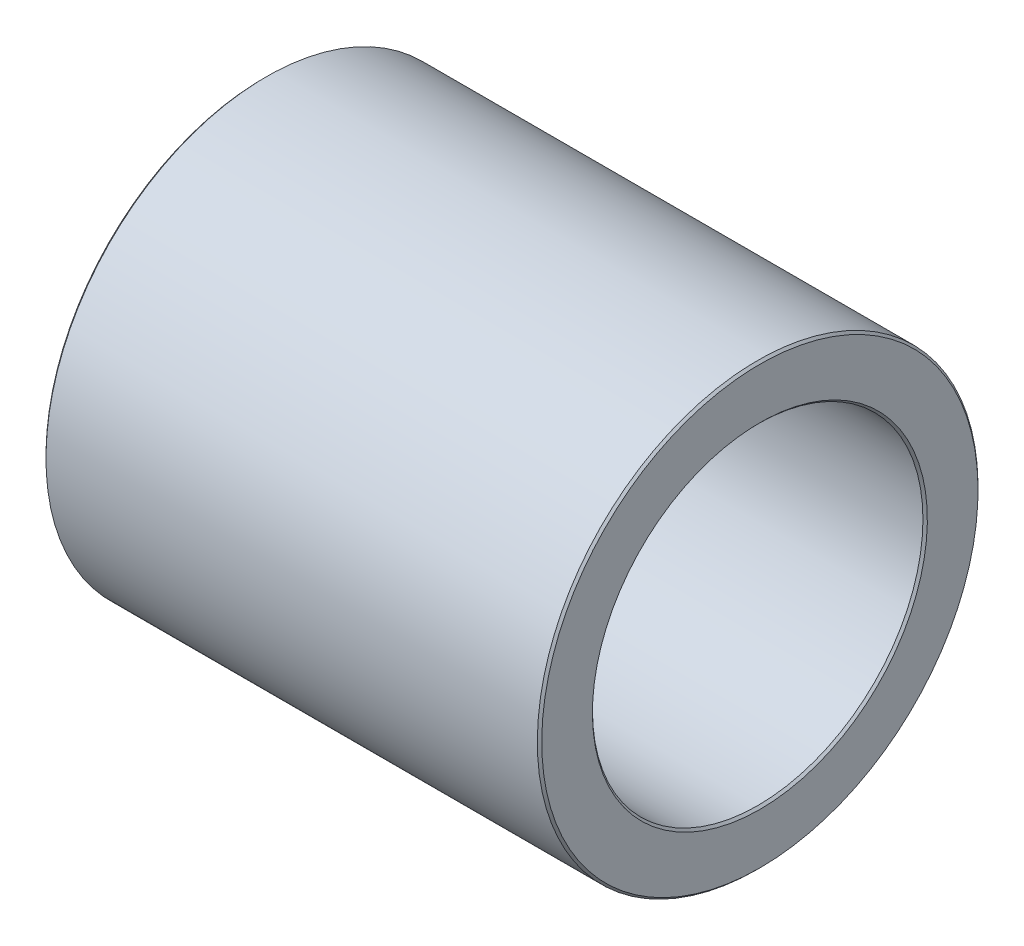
ISO-10303-21;
HEADER;
FILE_DESCRIPTION(('STEP AP214'),'2;1');
FILE_NAME('part.step','',(''),(''),'','','');
FILE_SCHEMA(('AUTOMOTIVE_DESIGN { 1 0 10303 214 1 1 1 1 }'));
ENDSEC;
DATA;
#1=APPLICATION_CONTEXT('core data for automotive mechanical design processes');
#2=APPLICATION_PROTOCOL_DEFINITION('international standard','automotive_design',2000,#1);
#3=PRODUCT_CONTEXT('',#1,'mechanical');
#4=PRODUCT('Part','Part','',(#3));
#5=PRODUCT_RELATED_PRODUCT_CATEGORY('part','',(#4));
#6=PRODUCT_DEFINITION_FORMATION('','',#4);
#7=PRODUCT_DEFINITION_CONTEXT('part definition',#1,'design');
#8=PRODUCT_DEFINITION('design','',#6,#7);
#9=PRODUCT_DEFINITION_SHAPE('','',#8);
#10=(LENGTH_UNIT() NAMED_UNIT(*) SI_UNIT(.MILLI.,.METRE.));
#11=(NAMED_UNIT(*) PLANE_ANGLE_UNIT() SI_UNIT($,.RADIAN.));
#12=(NAMED_UNIT(*) SI_UNIT($,.STERADIAN.) SOLID_ANGLE_UNIT());
#13=UNCERTAINTY_MEASURE_WITH_UNIT(LENGTH_MEASURE(1.E-05),#10,'distance_accuracy_value','');
#14=(GEOMETRIC_REPRESENTATION_CONTEXT(3) GLOBAL_UNCERTAINTY_ASSIGNED_CONTEXT((#13)) GLOBAL_UNIT_ASSIGNED_CONTEXT((#10,
#11,#12)) REPRESENTATION_CONTEXT('',''));
#15=CARTESIAN_POINT('',(0.,0.,0.));
#16=DIRECTION('',(0.,0.,1.));
#17=DIRECTION('',(1.,0.,0.));
#18=AXIS2_PLACEMENT_3D('',#15,#16,#17);
#19=CARTESIAN_POINT('',(0.,-35.,0.));
#20=DIRECTION('',(-1.,0.,0.));
#21=DIRECTION('',(0.,1.,0.));
#22=AXIS2_PLACEMENT_3D('',#19,#20,#21);
#23=PLANE('',#22);
#24=CARTESIAN_POINT('',(0.,0.,0.));
#25=DIRECTION('',(1.,0.,0.));
#26=DIRECTION('',(0.,-1.,0.));
#27=AXIS2_PLACEMENT_3D('',#24,#25,#26);
#28=CIRCLE('',#27,30.4);
#29=CARTESIAN_POINT('',(0.,-30.4,0.));
#30=VERTEX_POINT('',#29);
#31=EDGE_CURVE('E9',#30,#30,#28,.T.);
#32=ORIENTED_EDGE('',*,*,#31,.T.);
#33=EDGE_LOOP('',(#32));
#34=FACE_BOUND('',#33,.T.);
#35=CARTESIAN_POINT('',(0.,0.,0.));
#36=DIRECTION('',(1.,0.,0.));
#37=DIRECTION('',(0.,-1.,0.));
#38=AXIS2_PLACEMENT_3D('',#35,#36,#37);
#39=CIRCLE('',#38,39.6);
#40=CARTESIAN_POINT('',(0.,-39.6,0.));
#41=VERTEX_POINT('',#40);
#42=EDGE_CURVE('E53',#41,#41,#39,.T.);
#43=ORIENTED_EDGE('',*,*,#42,.F.);
#44=EDGE_LOOP('',(#43));
#45=FACE_BOUND('',#44,.T.);
#46=ADVANCED_FACE('F15',(#34,#45),#23,.T.);
#47=CARTESIAN_POINT('',(0.199999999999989,0.,0.));
#48=DIRECTION('',(-1.,0.,0.));
#49=DIRECTION('',(0.,-1.,0.));
#50=AXIS2_PLACEMENT_3D('',#47,#48,#49);
#51=CONICAL_SURFACE('',#50,30.2,0.785398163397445);
#52=CARTESIAN_POINT('',(0.4,0.,0.));
#53=DIRECTION('',(1.,0.,0.));
#54=DIRECTION('',(0.,-1.,0.));
#55=AXIS2_PLACEMENT_3D('',#52,#53,#54);
#56=CIRCLE('',#55,30.);
#57=CARTESIAN_POINT('',(0.4,-30.,0.));
#58=VERTEX_POINT('',#57);
#59=EDGE_CURVE('E22',#58,#58,#56,.T.);
#60=ORIENTED_EDGE('',*,*,#59,.T.);
#61=EDGE_LOOP('',(#60));
#62=FACE_BOUND('',#61,.T.);
#63=ORIENTED_EDGE('',*,*,#31,.F.);
#64=EDGE_LOOP('',(#63));
#65=FACE_BOUND('',#64,.T.);
#66=ADVANCED_FACE('F82',(#62,#65),#51,.F.);
#67=CARTESIAN_POINT('',(45.,0.,0.));
#68=DIRECTION('',(-1.,0.,0.));
#69=DIRECTION('',(0.,-1.,0.));
#70=AXIS2_PLACEMENT_3D('',#67,#68,#69);
#71=CYLINDRICAL_SURFACE('',#70,30.);
#72=CARTESIAN_POINT('',(89.6,0.,0.));
#73=DIRECTION('',(1.,0.,0.));
#74=DIRECTION('',(0.,-1.,0.));
#75=AXIS2_PLACEMENT_3D('',#72,#73,#74);
#76=CIRCLE('',#75,30.);
#77=CARTESIAN_POINT('',(89.6,-30.,0.));
#78=VERTEX_POINT('',#77);
#79=EDGE_CURVE('E58',#78,#78,#76,.T.);
#80=ORIENTED_EDGE('',*,*,#79,.T.);
#81=EDGE_LOOP('',(#80));
#82=FACE_BOUND('',#81,.T.);
#83=ORIENTED_EDGE('',*,*,#59,.F.);
#84=EDGE_LOOP('',(#83));
#85=FACE_BOUND('',#84,.T.);
#86=ADVANCED_FACE('F66',(#82,#85),#71,.F.);
#87=CARTESIAN_POINT('',(89.8,0.,0.));
#88=DIRECTION('',(1.,0.,0.));
#89=DIRECTION('',(0.,-1.,0.));
#90=AXIS2_PLACEMENT_3D('',#87,#88,#89);
#91=CONICAL_SURFACE('',#90,30.2,0.785398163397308);
#92=CARTESIAN_POINT('',(90.,0.,0.));
#93=DIRECTION('',(1.,0.,0.));
#94=DIRECTION('',(0.,-1.,0.));
#95=AXIS2_PLACEMENT_3D('',#92,#93,#94);
#96=CIRCLE('',#95,30.4);
#97=CARTESIAN_POINT('',(90.,-30.4,0.));
#98=VERTEX_POINT('',#97);
#99=EDGE_CURVE('E63',#98,#98,#96,.T.);
#100=ORIENTED_EDGE('',*,*,#99,.T.);
#101=EDGE_LOOP('',(#100));
#102=FACE_BOUND('',#101,.T.);
#103=ORIENTED_EDGE('',*,*,#79,.F.);
#104=EDGE_LOOP('',(#103));
#105=FACE_BOUND('',#104,.T.);
#106=ADVANCED_FACE('F69',(#102,#105),#91,.F.);
#107=CARTESIAN_POINT('',(90.,-35.,0.));
#108=DIRECTION('',(1.,0.,0.));
#109=DIRECTION('',(0.,-1.,0.));
#110=AXIS2_PLACEMENT_3D('',#107,#108,#109);
#111=PLANE('',#110);
#112=CARTESIAN_POINT('',(90.,0.,0.));
#113=DIRECTION('',(1.,0.,0.));
#114=DIRECTION('',(0.,-1.,0.));
#115=AXIS2_PLACEMENT_3D('',#112,#113,#114);
#116=CIRCLE('',#115,39.6);
#117=CARTESIAN_POINT('',(90.,-39.6,0.));
#118=VERTEX_POINT('',#117);
#119=EDGE_CURVE('E61',#118,#118,#116,.T.);
#120=ORIENTED_EDGE('',*,*,#119,.T.);
#121=EDGE_LOOP('',(#120));
#122=FACE_BOUND('',#121,.T.);
#123=ORIENTED_EDGE('',*,*,#99,.F.);
#124=EDGE_LOOP('',(#123));
#125=FACE_BOUND('',#124,.T.);
#126=ADVANCED_FACE('F71',(#122,#125),#111,.T.);
#127=CARTESIAN_POINT('',(89.8,0.,0.));
#128=DIRECTION('',(-1.,0.,0.));
#129=DIRECTION('',(0.,-1.,0.));
#130=AXIS2_PLACEMENT_3D('',#127,#128,#129);
#131=CONICAL_SURFACE('',#130,39.8,0.785398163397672);
#132=CARTESIAN_POINT('',(89.6,0.,0.));
#133=DIRECTION('',(1.,0.,0.));
#134=DIRECTION('',(0.,-1.,0.));
#135=AXIS2_PLACEMENT_3D('',#132,#133,#134);
#136=CIRCLE('',#135,40.);
#137=CARTESIAN_POINT('',(89.6,-40.,0.));
#138=VERTEX_POINT('',#137);
#139=EDGE_CURVE('E55',#138,#138,#136,.T.);
#140=ORIENTED_EDGE('',*,*,#139,.T.);
#141=EDGE_LOOP('',(#140));
#142=FACE_BOUND('',#141,.T.);
#143=ORIENTED_EDGE('',*,*,#119,.F.);
#144=EDGE_LOOP('',(#143));
#145=FACE_BOUND('',#144,.T.);
#146=ADVANCED_FACE('F79',(#142,#145),#131,.T.);
#147=CARTESIAN_POINT('',(45.,0.,0.));
#148=DIRECTION('',(-1.,0.,0.));
#149=DIRECTION('',(0.,-1.,0.));
#150=AXIS2_PLACEMENT_3D('',#147,#148,#149);
#151=CYLINDRICAL_SURFACE('',#150,40.);
#152=CARTESIAN_POINT('',(0.4,0.,0.));
#153=DIRECTION('',(1.,0.,0.));
#154=DIRECTION('',(0.,-1.,0.));
#155=AXIS2_PLACEMENT_3D('',#152,#153,#154);
#156=CIRCLE('',#155,40.);
#157=CARTESIAN_POINT('',(0.4,-40.,0.));
#158=VERTEX_POINT('',#157);
#159=EDGE_CURVE('E49',#158,#158,#156,.T.);
#160=ORIENTED_EDGE('',*,*,#159,.T.);
#161=EDGE_LOOP('',(#160));
#162=FACE_BOUND('',#161,.T.);
#163=ORIENTED_EDGE('',*,*,#139,.F.);
#164=EDGE_LOOP('',(#163));
#165=FACE_BOUND('',#164,.T.);
#166=ADVANCED_FACE('F50',(#162,#165),#151,.T.);
#167=CARTESIAN_POINT('',(0.200000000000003,0.,0.));
#168=DIRECTION('',(1.,0.,0.));
#169=DIRECTION('',(0.,-1.,0.));
#170=AXIS2_PLACEMENT_3D('',#167,#168,#169);
#171=CONICAL_SURFACE('',#170,39.8,0.785398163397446);
#172=ORIENTED_EDGE('',*,*,#42,.T.);
#173=EDGE_LOOP('',(#172));
#174=FACE_BOUND('',#173,.T.);
#175=ORIENTED_EDGE('',*,*,#159,.F.);
#176=EDGE_LOOP('',(#175));
#177=FACE_BOUND('',#176,.T.);
#178=ADVANCED_FACE('F92',(#174,#177),#171,.T.);
#179=CLOSED_SHELL('',(#46,#66,#86,#106,#126,#146,#166,#178));
#180=MANIFOLD_SOLID_BREP('B1',#179);
#181=ADVANCED_BREP_SHAPE_REPRESENTATION('',(#18,#180),#14);
#182=SHAPE_DEFINITION_REPRESENTATION(#9,#181);
ENDSEC;
END-ISO-10303-21;
